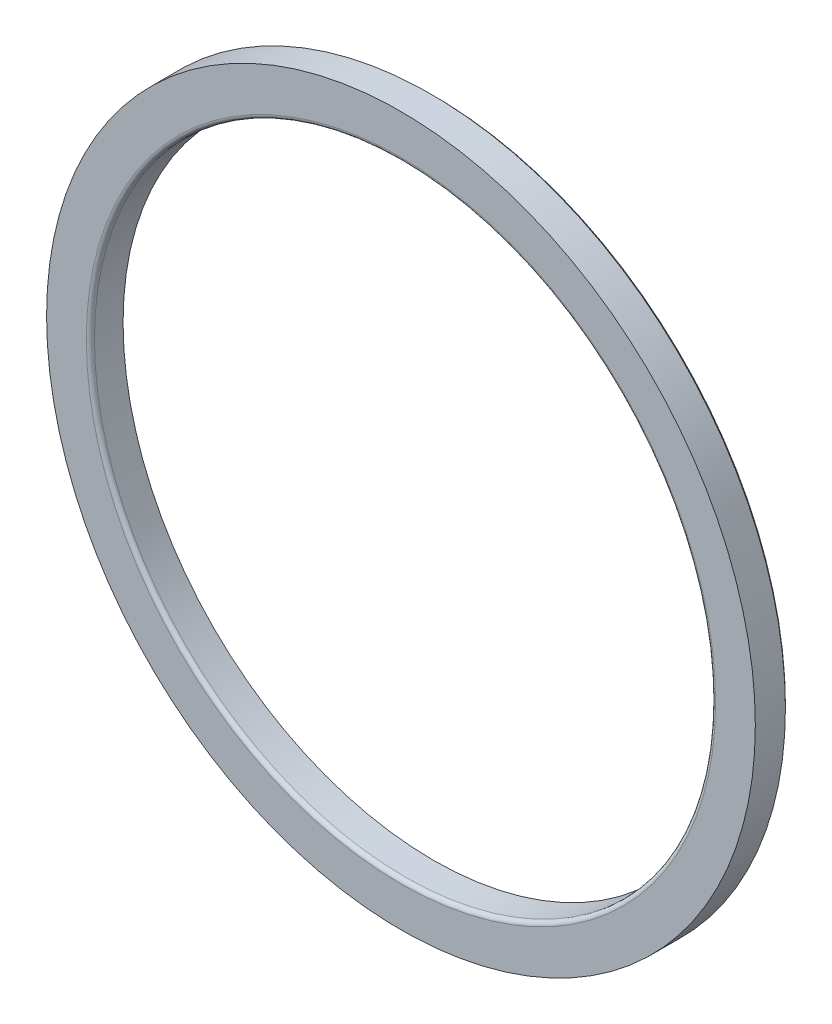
ISO-10303-21;
HEADER;
FILE_DESCRIPTION(('STEP AP214'),'2;1');
FILE_NAME('part.step','',(''),(''),'','','');
FILE_SCHEMA(('AUTOMOTIVE_DESIGN { 1 0 10303 214 1 1 1 1 }'));
ENDSEC;
DATA;
#1=APPLICATION_CONTEXT('core data for automotive mechanical design processes');
#2=APPLICATION_PROTOCOL_DEFINITION('international standard','automotive_design',2000,#1);
#3=PRODUCT_CONTEXT('',#1,'mechanical');
#4=PRODUCT('Part','Part','',(#3));
#5=PRODUCT_RELATED_PRODUCT_CATEGORY('part','',(#4));
#6=PRODUCT_DEFINITION_FORMATION('','',#4);
#7=PRODUCT_DEFINITION_CONTEXT('part definition',#1,'design');
#8=PRODUCT_DEFINITION('design','',#6,#7);
#9=PRODUCT_DEFINITION_SHAPE('','',#8);
#10=(LENGTH_UNIT() NAMED_UNIT(*) SI_UNIT(.MILLI.,.METRE.));
#11=(NAMED_UNIT(*) PLANE_ANGLE_UNIT() SI_UNIT($,.RADIAN.));
#12=(NAMED_UNIT(*) SI_UNIT($,.STERADIAN.) SOLID_ANGLE_UNIT());
#13=UNCERTAINTY_MEASURE_WITH_UNIT(LENGTH_MEASURE(1.E-05),#10,'distance_accuracy_value','');
#14=(GEOMETRIC_REPRESENTATION_CONTEXT(3) GLOBAL_UNCERTAINTY_ASSIGNED_CONTEXT((#13)) GLOBAL_UNIT_ASSIGNED_CONTEXT((#10,
#11,#12)) REPRESENTATION_CONTEXT('',''));
#15=CARTESIAN_POINT('',(0.,0.,0.));
#16=DIRECTION('',(0.,0.,1.));
#17=DIRECTION('',(1.,0.,0.));
#18=AXIS2_PLACEMENT_3D('',#15,#16,#17);
#19=CARTESIAN_POINT('',(0.,0.,6.35));
#20=DIRECTION('',(0.,0.,1.));
#21=DIRECTION('',(1.,0.,0.));
#22=AXIS2_PLACEMENT_3D('',#19,#20,#21);
#23=PLANE('',#22);
#24=CARTESIAN_POINT('',(0.,0.,6.35));
#25=DIRECTION('',(0.,0.,1.));
#26=DIRECTION('',(1.,0.,0.));
#27=AXIS2_PLACEMENT_3D('',#24,#25,#26);
#28=CIRCLE('',#27,61.11875);
#29=CARTESIAN_POINT('',(61.11875,0.,6.35));
#30=VERTEX_POINT('',#29);
#31=EDGE_CURVE('E12',#30,#30,#28,.F.);
#32=ORIENTED_EDGE('',*,*,#31,.T.);
#33=EDGE_LOOP('',(#32));
#34=FACE_BOUND('',#33,.T.);
#35=CARTESIAN_POINT('',(0.,0.,6.35));
#36=DIRECTION('',(0.,0.,1.));
#37=DIRECTION('',(1.,0.,0.));
#38=AXIS2_PLACEMENT_3D('',#35,#36,#37);
#39=CIRCLE('',#38,68.834);
#40=CARTESIAN_POINT('',(68.834,0.,6.35));
#41=VERTEX_POINT('',#40);
#42=EDGE_CURVE('E73',#41,#41,#39,.T.);
#43=ORIENTED_EDGE('',*,*,#42,.T.);
#44=EDGE_LOOP('',(#43));
#45=FACE_BOUND('',#44,.T.);
#46=ADVANCED_FACE('F49',(#34,#45),#23,.T.);
#47=CARTESIAN_POINT('',(0.,0.,0.));
#48=DIRECTION('',(0.,0.,1.));
#49=DIRECTION('',(1.,0.,0.));
#50=AXIS2_PLACEMENT_3D('',#47,#48,#49);
#51=PLANE('',#50);
#52=CARTESIAN_POINT('',(0.,0.,0.));
#53=DIRECTION('',(0.,0.,1.));
#54=DIRECTION('',(1.,0.,0.));
#55=AXIS2_PLACEMENT_3D('',#52,#53,#54);
#56=CIRCLE('',#55,68.326);
#57=CARTESIAN_POINT('',(68.326,0.,0.));
#58=VERTEX_POINT('',#57);
#59=EDGE_CURVE('E62',#58,#58,#56,.F.);
#60=ORIENTED_EDGE('',*,*,#59,.T.);
#61=EDGE_LOOP('',(#60));
#62=FACE_BOUND('',#61,.T.);
#63=CARTESIAN_POINT('',(0.,0.,0.));
#64=DIRECTION('',(0.,0.,1.));
#65=DIRECTION('',(1.,0.,0.));
#66=AXIS2_PLACEMENT_3D('',#63,#64,#65);
#67=CIRCLE('',#66,60.325);
#68=CARTESIAN_POINT('',(60.325,0.,0.));
#69=VERTEX_POINT('',#68);
#70=EDGE_CURVE('E77',#69,#69,#67,.T.);
#71=ORIENTED_EDGE('',*,*,#70,.T.);
#72=EDGE_LOOP('',(#71));
#73=FACE_BOUND('',#72,.T.);
#74=ADVANCED_FACE('F82',(#62,#73),#51,.F.);
#75=CARTESIAN_POINT('',(0.,0.,6.35));
#76=DIRECTION('',(0.,0.,-1.));
#77=DIRECTION('',(-1.,0.,0.));
#78=AXIS2_PLACEMENT_3D('',#75,#76,#77);
#79=CYLINDRICAL_SURFACE('',#78,68.834);
#80=CARTESIAN_POINT('',(0.,0.,0.507999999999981));
#81=DIRECTION('',(0.,0.,1.));
#82=DIRECTION('',(1.,0.,0.));
#83=AXIS2_PLACEMENT_3D('',#80,#81,#82);
#84=CIRCLE('',#83,68.834);
#85=CARTESIAN_POINT('',(68.834,0.,0.507999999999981));
#86=VERTEX_POINT('',#85);
#87=EDGE_CURVE('E67',#86,#86,#84,.T.);
#88=ORIENTED_EDGE('',*,*,#87,.T.);
#89=EDGE_LOOP('',(#88));
#90=FACE_BOUND('',#89,.T.);
#91=ORIENTED_EDGE('',*,*,#42,.F.);
#92=EDGE_LOOP('',(#91));
#93=FACE_BOUND('',#92,.T.);
#94=ADVANCED_FACE('F87',(#90,#93),#79,.T.);
#95=CARTESIAN_POINT('',(0.,0.,6.35));
#96=DIRECTION('',(0.,0.,-1.));
#97=DIRECTION('',(-1.,0.,0.));
#98=AXIS2_PLACEMENT_3D('',#95,#96,#97);
#99=CYLINDRICAL_SURFACE('',#98,60.325);
#100=CARTESIAN_POINT('',(0.,0.,5.55625));
#101=DIRECTION('',(0.,0.,1.));
#102=DIRECTION('',(1.,0.,0.));
#103=AXIS2_PLACEMENT_3D('',#100,#101,#102);
#104=CIRCLE('',#103,60.325);
#105=CARTESIAN_POINT('',(60.325,0.,5.55625));
#106=VERTEX_POINT('',#105);
#107=EDGE_CURVE('E57',#106,#106,#104,.T.);
#108=ORIENTED_EDGE('',*,*,#107,.T.);
#109=EDGE_LOOP('',(#108));
#110=FACE_BOUND('',#109,.T.);
#111=ORIENTED_EDGE('',*,*,#70,.F.);
#112=EDGE_LOOP('',(#111));
#113=FACE_BOUND('',#112,.T.);
#114=ADVANCED_FACE('F84',(#110,#113),#99,.F.);
#115=CARTESIAN_POINT('',(0.,0.,0.507999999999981));
#116=DIRECTION('',(0.,0.,1.));
#117=DIRECTION('',(1.,0.,0.));
#118=AXIS2_PLACEMENT_3D('',#115,#116,#117);
#119=CONICAL_SURFACE('',#118,68.834,0.785398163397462);
#120=ORIENTED_EDGE('',*,*,#59,.F.);
#121=EDGE_LOOP('',(#120));
#122=FACE_BOUND('',#121,.T.);
#123=ORIENTED_EDGE('',*,*,#87,.F.);
#124=EDGE_LOOP('',(#123));
#125=FACE_BOUND('',#124,.T.);
#126=ADVANCED_FACE('F86',(#122,#125),#119,.T.);
#127=CARTESIAN_POINT('',(0.,0.,5.55625));
#128=DIRECTION('',(0.,0.,1.));
#129=DIRECTION('',(1.,0.,0.));
#130=AXIS2_PLACEMENT_3D('',#127,#128,#129);
#131=TOROIDAL_SURFACE('',#130,61.11875,0.79375);
#132=ORIENTED_EDGE('',*,*,#31,.F.);
#133=EDGE_LOOP('',(#132));
#134=FACE_BOUND('',#133,.T.);
#135=ORIENTED_EDGE('',*,*,#107,.F.);
#136=EDGE_LOOP('',(#135));
#137=FACE_BOUND('',#136,.T.);
#138=ADVANCED_FACE('F51',(#134,#137),#131,.T.);
#139=CLOSED_SHELL('',(#46,#74,#94,#114,#126,#138));
#140=MANIFOLD_SOLID_BREP('B2',#139);
#141=ADVANCED_BREP_SHAPE_REPRESENTATION('',(#18,#140),#14);
#142=SHAPE_DEFINITION_REPRESENTATION(#9,#141);
ENDSEC;
END-ISO-10303-21;
